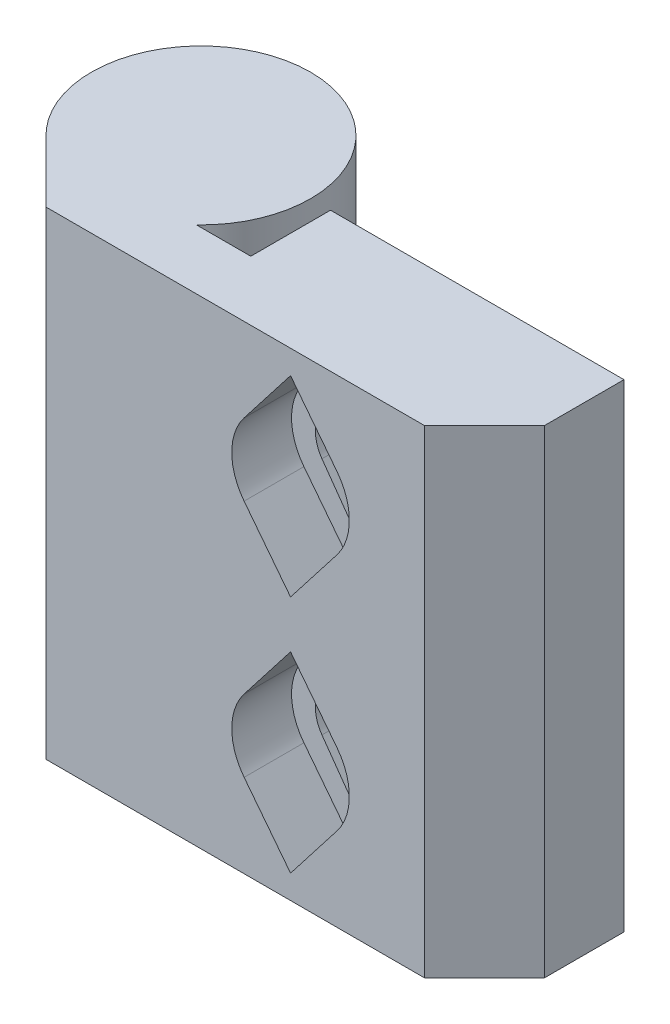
from build123d import *

# Parameters (mm, degrees)
SKETCH1_R           = 5.5
SKETCH1_R_2         = 5
BOSS_EXTRUDE1_DEPTH = 12
SKETCH2_R           = 5.5
BOSS_EXTRUDE2_DEPTH = 12
BOSS_EXTRUDE3_REACH = 27.229
SKETCH4_R           = 5
CUT_EXTRUDE1_DEPTH  = 12
SKETCH5_W           = 14.725082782
SKETCH5_H           = 24
BOSS_EXTRUDE4_DEPTH = 4
CUT_EXTRUDE2_DEPTH  = 3
CUT_EXTRUDE3_REACH  = 35.418


with BuildPart() as part:
    # Sketch1 → Boss-Extrude1 (new body)
    with BuildSketch(Plane(origin=(0, 0, 0), x_dir=(1, 0, 0), z_dir=(0, 1, 0))):
        with Locations(Location((0, 0, 0), (0, 0, 270))):
            Circle(SKETCH1_R)
        with Locations(Location((0, 0, 0), (0, 0, 270))):
            Circle(SKETCH1_R_2, mode=Mode.SUBTRACT)
    extrude(amount=BOSS_EXTRUDE1_DEPTH)

    # Sketch2 → Boss-Extrude2 (add)
    with BuildSketch(Plane(origin=(0, 12, 0), x_dir=(1, 0, 0), z_dir=(0, 1, 0))):
        with Locations(Location((0, 0, 0), (0, 0, 270))):
            Circle(SKETCH2_R)
    extrude(amount=BOSS_EXTRUDE2_DEPTH)

    # Boss-Extrude3: up to this face of the body (flat: up to its plane)
    boss_extrude3_end = Plane(part.part.faces().sort_by_distance((0, 24, 0))[0])
    # Sketch3 → Boss-Extrude3 (add, up to the picked face)
    with BuildSketch(Plane(origin=(0, 0, 0), x_dir=(1, 0, 0), z_dir=(0, 1, 0)), mode=Mode.PRIVATE) as boss_extrude3_sk1:
        Polygon((-3.774917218, -4), (21.225082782, -4), (18.225082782, -7), (-0.774917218, -7), align=None)
    boss_extrude3_tool1 = split(extrude(boss_extrude3_sk1.sketch, amount=BOSS_EXTRUDE3_REACH, mode=Mode.PRIVATE), bisect_by=boss_extrude3_end, keep=Keep.BOTH, mode=Mode.PRIVATE)
    add(boss_extrude3_tool1.solids().sort_by(Axis((8.725083, 0, 5.431818), (0, 1, 0)))[0])

    # Sketch4 → Cut-Extrude1 (cut)
    with BuildSketch(Plane.XZ):
        with Locations(Location((0, 0, 0), (0, 0, 90))):
            Circle(SKETCH4_R)
    extrude(amount=-CUT_EXTRUDE1_DEPTH, mode=Mode.SUBTRACT)

    # Sketch5 → Boss-Extrude4 (add)
    with BuildSketch(Plane(origin=(0, 0, 4), x_dir=(-1, 0, 0), z_dir=(0, 0, -1))):
        with Locations((-13.862541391, 12)):
            Rectangle(SKETCH5_W, SKETCH5_H)
    extrude(amount=BOSS_EXTRUDE4_DEPTH)

    # Sketch6 → Cut-Extrude2 (cut)
    with BuildSketch(Plane.XY.offset(7)):
        with BuildLine():
            Line((9.165196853, 19.809456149), (11.495082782, 22.809456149))
            Line((11.495082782, 22.809456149), (13.824968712, 19.809456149))
            ThreePointArc((13.824968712, 19.809456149), (14.445082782, 18), (13.824968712, 16.190543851))
            Line((13.824968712, 16.190543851), (11.495082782, 13.190543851))
            Line((11.495082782, 13.190543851), (9.165196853, 16.190543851))
            ThreePointArc((9.165196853, 16.190543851), (8.545082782, 18), (9.165196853, 19.809456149))
        make_face()
        with BuildLine():
            Line((11.495082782, 10.809456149), (13.824968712, 7.809456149))
            ThreePointArc((13.824968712, 7.809456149), (14.445082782, 6), (13.824968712, 4.190543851))
            Line((13.824968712, 4.190543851), (11.495082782, 1.190543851))
            Line((11.495082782, 1.190543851), (9.165196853, 4.190543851))
            ThreePointArc((9.165196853, 4.190543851), (8.545082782, 6), (9.165196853, 7.809456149))
            Line((9.165196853, 7.809456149), (11.495082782, 10.809456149))
        make_face()
    extrude(amount=-CUT_EXTRUDE2_DEPTH, mode=Mode.SUBTRACT)

    # Sketch7 → Cut-Extrude3 (cut, up to next)
    with BuildSketch(Plane.XY.offset(4), mode=Mode.PRIVATE) as cut_extrude3_sk1:
        with BuildLine():
            Line((10.069905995, 19.015564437), (11.495082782, 21.015564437))
            Line((11.495082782, 21.015564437), (12.920259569, 19.015564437))
            ThreePointArc((12.920259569, 19.015564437), (13.245082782, 18), (12.920259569, 16.984435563))
            Line((12.920259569, 16.984435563), (11.495082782, 14.984435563))
            Line((11.495082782, 14.984435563), (10.069905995, 16.984435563))
            ThreePointArc((10.069905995, 16.984435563), (9.745082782, 18), (10.069905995, 19.015564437))
        make_face()
    cut_extrude3_tool1 = extrude(cut_extrude3_sk1.sketch, amount=-CUT_EXTRUDE3_REACH, mode=Mode.PRIVATE) & part.part
    # Sketch7 → Cut-Extrude3 (cut, up to next)
    with BuildSketch(Plane.XY.offset(4), mode=Mode.PRIVATE) as cut_extrude3_sk2:
        with BuildLine():
            Line((10.069905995, 7.015564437), (11.495082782, 9.015564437))
            Line((11.495082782, 9.015564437), (12.920259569, 7.015564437))
            ThreePointArc((12.920259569, 7.015564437), (13.245082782, 6), (12.920259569, 4.984435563))
            Line((12.920259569, 4.984435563), (11.495082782, 2.984435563))
            Line((11.495082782, 2.984435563), (10.069905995, 4.984435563))
            ThreePointArc((10.069905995, 4.984435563), (9.745082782, 6), (10.069905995, 7.015564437))
        make_face()
    cut_extrude3_tool2 = extrude(cut_extrude3_sk2.sketch, amount=-CUT_EXTRUDE3_REACH, mode=Mode.PRIVATE) & part.part
    add(cut_extrude3_tool1.solids().sort_by_distance((11.495083, 18, 4))[0], mode=Mode.SUBTRACT)
    add(cut_extrude3_tool2.solids().sort_by_distance((11.495083, 6, 4))[0], mode=Mode.SUBTRACT)


solid = part.part
